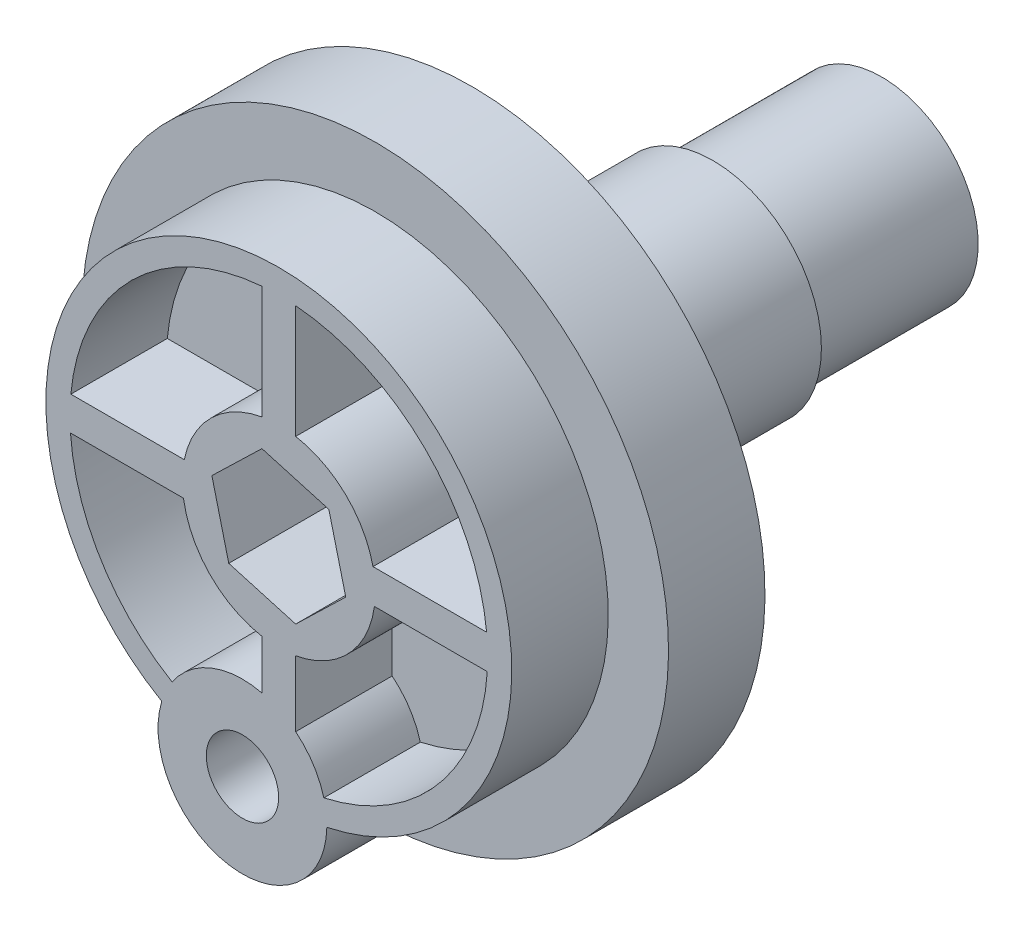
ISO-10303-21;
HEADER;
FILE_DESCRIPTION(('STEP AP214'),'2;1');
FILE_NAME('part.step','',(''),(''),'','','');
FILE_SCHEMA(('AUTOMOTIVE_DESIGN { 1 0 10303 214 1 1 1 1 }'));
ENDSEC;
DATA;
#1=APPLICATION_CONTEXT('core data for automotive mechanical design processes');
#2=APPLICATION_PROTOCOL_DEFINITION('international standard','automotive_design',2000,#1);
#3=PRODUCT_CONTEXT('',#1,'mechanical');
#4=PRODUCT('Part','Part','',(#3));
#5=PRODUCT_RELATED_PRODUCT_CATEGORY('part','',(#4));
#6=PRODUCT_DEFINITION_FORMATION('','',#4);
#7=PRODUCT_DEFINITION_CONTEXT('part definition',#1,'design');
#8=PRODUCT_DEFINITION('design','',#6,#7);
#9=PRODUCT_DEFINITION_SHAPE('','',#8);
#10=(LENGTH_UNIT() NAMED_UNIT(*) SI_UNIT(.MILLI.,.METRE.));
#11=(NAMED_UNIT(*) PLANE_ANGLE_UNIT() SI_UNIT($,.RADIAN.));
#12=(NAMED_UNIT(*) SI_UNIT($,.STERADIAN.) SOLID_ANGLE_UNIT());
#13=UNCERTAINTY_MEASURE_WITH_UNIT(LENGTH_MEASURE(1.E-05),#10,'distance_accuracy_value','');
#14=(GEOMETRIC_REPRESENTATION_CONTEXT(3) GLOBAL_UNCERTAINTY_ASSIGNED_CONTEXT((#13)) GLOBAL_UNIT_ASSIGNED_CONTEXT((#10,
#11,#12)) REPRESENTATION_CONTEXT('',''));
#15=CARTESIAN_POINT('',(0.,0.,0.));
#16=DIRECTION('',(0.,0.,1.));
#17=DIRECTION('',(1.,0.,0.));
#18=AXIS2_PLACEMENT_3D('',#15,#16,#17);
#19=CARTESIAN_POINT('',(0.,0.,-12.));
#20=DIRECTION('',(0.,0.,-1.));
#21=DIRECTION('',(-1.,0.,0.));
#22=AXIS2_PLACEMENT_3D('',#19,#20,#21);
#23=PLANE('',#22);
#24=CARTESIAN_POINT('',(0.,0.,-12.));
#25=DIRECTION('',(0.,0.,-1.));
#26=DIRECTION('',(-1.,0.,0.));
#27=AXIS2_PLACEMENT_3D('',#24,#25,#26);
#28=CIRCLE('',#27,4.5);
#29=CARTESIAN_POINT('',(-4.5,0.,-12.));
#30=VERTEX_POINT('',#29);
#31=EDGE_CURVE('E623',#30,#30,#28,.T.);
#32=ORIENTED_EDGE('',*,*,#31,.T.);
#33=EDGE_LOOP('',(#32));
#34=FACE_BOUND('',#33,.T.);
#35=CARTESIAN_POINT('',(0.,0.,-12.));
#36=DIRECTION('',(0.,0.,-1.));
#37=DIRECTION('',(-1.,0.,0.));
#38=AXIS2_PLACEMENT_3D('',#35,#36,#37);
#39=CIRCLE('',#38,4.);
#40=CARTESIAN_POINT('',(-4.,0.,-12.));
#41=VERTEX_POINT('',#40);
#42=EDGE_CURVE('E617',#41,#41,#39,.T.);
#43=ORIENTED_EDGE('',*,*,#42,.F.);
#44=EDGE_LOOP('',(#43));
#45=FACE_BOUND('',#44,.T.);
#46=ADVANCED_FACE('F348',(#34,#45),#23,.T.);
#47=CARTESIAN_POINT('',(0.,0.,0.));
#48=DIRECTION('',(0.,0.,1.));
#49=DIRECTION('',(1.,0.,0.));
#50=AXIS2_PLACEMENT_3D('',#47,#48,#49);
#51=PLANE('',#50);
#52=CARTESIAN_POINT('',(0.,0.,0.));
#53=DIRECTION('',(0.,0.,-1.));
#54=DIRECTION('',(-1.,0.,0.));
#55=AXIS2_PLACEMENT_3D('',#52,#53,#54);
#56=CIRCLE('',#55,11.16);
#57=CARTESIAN_POINT('',(-4.95189957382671,-10.0012144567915,0.));
#58=VERTEX_POINT('',#57);
#59=CARTESIAN_POINT('',(1.56886788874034,-11.0491743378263,0.));
#60=VERTEX_POINT('',#59);
#61=EDGE_CURVE('E550',#58,#60,#56,.T.);
#62=ORIENTED_EDGE('',*,*,#61,.T.);
#63=CARTESIAN_POINT('',(-1.50747036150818,-9.38,0.));
#64=DIRECTION('',(0.,0.,1.));
#65=DIRECTION('',(1.,0.,0.));
#66=AXIS2_PLACEMENT_3D('',#63,#64,#65);
#67=CIRCLE('',#66,3.5);
#68=EDGE_CURVE('E362',#60,#58,#67,.T.);
#69=ORIENTED_EDGE('',*,*,#68,.T.);
#70=EDGE_LOOP('',(#62,#69));
#71=FACE_BOUND('',#70,.T.);
#72=CARTESIAN_POINT('',(0.,0.,0.));
#73=DIRECTION('',(0.,0.,1.));
#74=DIRECTION('',(1.,0.,0.));
#75=AXIS2_PLACEMENT_3D('',#72,#73,#74);
#76=CIRCLE('',#75,4.5);
#77=CARTESIAN_POINT('',(4.5,0.,0.));
#78=VERTEX_POINT('',#77);
#79=EDGE_CURVE('E356',#78,#78,#76,.F.);
#80=ORIENTED_EDGE('',*,*,#79,.F.);
#81=EDGE_LOOP('',(#80));
#82=FACE_BOUND('',#81,.T.);
#83=ADVANCED_FACE('F777',(#71,#82),#51,.F.);
#84=CARTESIAN_POINT('',(0.,0.,2.));
#85=DIRECTION('',(0.,0.,1.));
#86=DIRECTION('',(1.,0.,0.));
#87=AXIS2_PLACEMENT_3D('',#84,#85,#86);
#88=PLANE('',#87);
#89=CARTESIAN_POINT('',(-1.50747036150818,-9.38,2.));
#90=DIRECTION('',(0.,0.,1.));
#91=DIRECTION('',(1.,0.,0.));
#92=AXIS2_PLACEMENT_3D('',#89,#90,#91);
#93=CIRCLE('',#92,3.5);
#94=CARTESIAN_POINT('',(-4.8532083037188,-8.35236308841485,2.));
#95=VERTEX_POINT('',#94);
#96=CARTESIAN_POINT('',(-4.41336996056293,-11.3308325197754,2.));
#97=VERTEX_POINT('',#96);
#98=EDGE_CURVE('E589',#95,#97,#93,.T.);
#99=ORIENTED_EDGE('',*,*,#98,.F.);
#100=CARTESIAN_POINT('',(0.,0.,2.));
#101=DIRECTION('',(0.,0.,1.));
#102=DIRECTION('',(1.,0.,0.));
#103=AXIS2_PLACEMENT_3D('',#100,#101,#102);
#104=CIRCLE('',#103,9.66);
#105=CARTESIAN_POINT('',(1.99178013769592,-9.45242888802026,2.));
#106=VERTEX_POINT('',#105);
#107=EDGE_CURVE('E761',#106,#95,#104,.T.);
#108=ORIENTED_EDGE('',*,*,#107,.F.);
#109=CARTESIAN_POINT('',(0.640847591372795,-12.1431015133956,2.));
#110=VERTEX_POINT('',#109);
#111=EDGE_CURVE('E586',#110,#106,#93,.T.);
#112=ORIENTED_EDGE('',*,*,#111,.F.);
#113=CARTESIAN_POINT('',(0.,0.,2.));
#114=DIRECTION('',(0.,0.,1.));
#115=DIRECTION('',(1.,0.,0.));
#116=AXIS2_PLACEMENT_3D('',#113,#114,#115);
#117=CIRCLE('',#116,12.16);
#118=EDGE_CURVE('E770',#110,#97,#117,.T.);
#119=ORIENTED_EDGE('',*,*,#118,.T.);
#120=EDGE_LOOP('',(#99,#108,#112,#119));
#121=FACE_BOUND('',#120,.T.);
#122=ADVANCED_FACE('F779',(#121),#88,.T.);
#123=CARTESIAN_POINT('',(0.,0.,2.));
#124=DIRECTION('',(0.,0.,-1.));
#125=DIRECTION('',(-1.,0.,0.));
#126=AXIS2_PLACEMENT_3D('',#123,#124,#125);
#127=CYLINDRICAL_SURFACE('',#126,12.16);
#128=CARTESIAN_POINT('',(0.,0.,-2.));
#129=DIRECTION('',(0.,0.,-1.));
#130=DIRECTION('',(-1.,0.,0.));
#131=AXIS2_PLACEMENT_3D('',#128,#129,#130);
#132=CIRCLE('',#131,12.16);
#133=CARTESIAN_POINT('',(-4.41336996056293,-11.3308325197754,-2.));
#134=VERTEX_POINT('',#133);
#135=CARTESIAN_POINT('',(0.640847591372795,-12.1431015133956,-2.));
#136=VERTEX_POINT('',#135);
#137=EDGE_CURVE('E549',#134,#136,#132,.T.);
#138=ORIENTED_EDGE('',*,*,#137,.F.);
#139=DIRECTION('',(0.,0.,1.));
#140=VECTOR('',#139,1.);
#141=CARTESIAN_POINT('',(-4.41336996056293,-11.3308325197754,2.));
#142=LINE('',#141,#140);
#143=EDGE_CURVE('E556',#134,#97,#142,.T.);
#144=ORIENTED_EDGE('',*,*,#143,.T.);
#145=ORIENTED_EDGE('',*,*,#118,.F.);
#146=DIRECTION('',(0.,0.,1.));
#147=VECTOR('',#146,1.);
#148=CARTESIAN_POINT('',(0.640847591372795,-12.1431015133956,2.));
#149=LINE('',#148,#147);
#150=EDGE_CURVE('E588',#110,#136,#149,.F.);
#151=ORIENTED_EDGE('',*,*,#150,.T.);
#152=EDGE_LOOP('',(#138,#144,#145,#151));
#153=FACE_BOUND('',#152,.T.);
#154=ADVANCED_FACE('F350',(#153),#127,.T.);
#155=CARTESIAN_POINT('',(0.,0.,-2.));
#156=DIRECTION('',(0.,0.,-1.));
#157=DIRECTION('',(-1.,0.,0.));
#158=AXIS2_PLACEMENT_3D('',#155,#156,#157);
#159=PLANE('',#158);
#160=CARTESIAN_POINT('',(-1.50747036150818,-9.38,-2.));
#161=DIRECTION('',(0.,0.,-1.));
#162=DIRECTION('',(-1.,0.,0.));
#163=AXIS2_PLACEMENT_3D('',#160,#161,#162);
#164=CIRCLE('',#163,1.5);
#165=CARTESIAN_POINT('',(-3.00747036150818,-9.38,-2.));
#166=VERTEX_POINT('',#165);
#167=EDGE_CURVE('E926',#166,#166,#164,.T.);
#168=ORIENTED_EDGE('',*,*,#167,.F.);
#169=EDGE_LOOP('',(#168));
#170=FACE_BOUND('',#169,.T.);
#171=ORIENTED_EDGE('',*,*,#137,.T.);
#172=CARTESIAN_POINT('',(-1.50747036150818,-9.38,-2.));
#173=DIRECTION('',(0.,0.,1.));
#174=DIRECTION('',(1.,0.,0.));
#175=AXIS2_PLACEMENT_3D('',#172,#173,#174);
#176=CIRCLE('',#175,3.5);
#177=EDGE_CURVE('E559',#134,#136,#176,.T.);
#178=ORIENTED_EDGE('',*,*,#177,.F.);
#179=EDGE_LOOP('',(#171,#178));
#180=FACE_BOUND('',#179,.T.);
#181=CARTESIAN_POINT('',(1.56886788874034,-11.0491743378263,-2.));
#182=VERTEX_POINT('',#181);
#183=CARTESIAN_POINT('',(-4.95189957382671,-10.0012144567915,-2.));
#184=VERTEX_POINT('',#183);
#185=EDGE_CURVE('E548',#182,#184,#176,.T.);
#186=ORIENTED_EDGE('',*,*,#185,.F.);
#187=CARTESIAN_POINT('',(0.,0.,-2.));
#188=DIRECTION('',(0.,0.,-1.));
#189=DIRECTION('',(-1.,0.,0.));
#190=AXIS2_PLACEMENT_3D('',#187,#188,#189);
#191=CIRCLE('',#190,11.16);
#192=EDGE_CURVE('E544',#184,#182,#191,.T.);
#193=ORIENTED_EDGE('',*,*,#192,.F.);
#194=EDGE_LOOP('',(#186,#193));
#195=FACE_BOUND('',#194,.T.);
#196=ADVANCED_FACE('F546',(#170,#180,#195),#159,.T.);
#197=CARTESIAN_POINT('',(0.,0.,-2.));
#198=DIRECTION('',(0.,0.,1.));
#199=DIRECTION('',(1.,0.,0.));
#200=AXIS2_PLACEMENT_3D('',#197,#198,#199);
#201=CYLINDRICAL_SURFACE('',#200,11.16);
#202=DIRECTION('',(0.,0.,1.));
#203=VECTOR('',#202,1.);
#204=CARTESIAN_POINT('',(1.56886788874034,-11.0491743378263,2.));
#205=LINE('',#204,#203);
#206=EDGE_CURVE('E369',#60,#182,#205,.F.);
#207=ORIENTED_EDGE('',*,*,#206,.F.);
#208=ORIENTED_EDGE('',*,*,#61,.F.);
#209=DIRECTION('',(0.,0.,1.));
#210=VECTOR('',#209,1.);
#211=CARTESIAN_POINT('',(-4.95189957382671,-10.0012144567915,2.));
#212=LINE('',#211,#210);
#213=EDGE_CURVE('E553',#184,#58,#212,.T.);
#214=ORIENTED_EDGE('',*,*,#213,.F.);
#215=ORIENTED_EDGE('',*,*,#192,.T.);
#216=EDGE_LOOP('',(#207,#208,#214,#215));
#217=FACE_BOUND('',#216,.T.);
#218=ADVANCED_FACE('F554',(#217),#201,.F.);
#219=CARTESIAN_POINT('',(0.,0.,6.));
#220=DIRECTION('',(0.,0.,1.));
#221=DIRECTION('',(1.,0.,0.));
#222=AXIS2_PLACEMENT_3D('',#219,#220,#221);
#223=PLANE('',#222);
#224=CARTESIAN_POINT('',(-1.50747036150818,-9.38,6.));
#225=DIRECTION('',(0.,0.,1.));
#226=DIRECTION('',(1.,0.,0.));
#227=AXIS2_PLACEMENT_3D('',#224,#225,#226);
#228=CIRCLE('',#227,1.5);
#229=CARTESIAN_POINT('',(-0.00747036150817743,-9.38,6.));
#230=VERTEX_POINT('',#229);
#231=EDGE_CURVE('E939',#230,#230,#228,.T.);
#232=ORIENTED_EDGE('',*,*,#231,.F.);
#233=EDGE_LOOP('',(#232));
#234=FACE_BOUND('',#233,.T.);
#235=DIRECTION('',(0.,1.,0.));
#236=VECTOR('',#235,1.);
#237=CARTESIAN_POINT('',(-0.699999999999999,-5.97450650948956,6.));
#238=LINE('',#237,#236);
#239=CARTESIAN_POINT('',(-0.699999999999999,-5.97441758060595,6.));
#240=VERTEX_POINT('',#239);
#241=CARTESIAN_POINT('',(-0.700000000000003,-3.93827373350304,6.));
#242=VERTEX_POINT('',#241);
#243=EDGE_CURVE('E716',#240,#242,#238,.T.);
#244=ORIENTED_EDGE('',*,*,#243,.F.);
#245=CARTESIAN_POINT('',(-1.50747036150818,-9.38,6.));
#246=DIRECTION('',(0.,0.,1.));
#247=DIRECTION('',(1.,0.,0.));
#248=AXIS2_PLACEMENT_3D('',#245,#246,#247);
#249=CIRCLE('',#248,3.5);
#250=CARTESIAN_POINT('',(-4.42382022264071,-7.44482468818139,6.));
#251=VERTEX_POINT('',#250);
#252=EDGE_CURVE('E564',#240,#251,#249,.T.);
#253=ORIENTED_EDGE('',*,*,#252,.T.);
#254=CARTESIAN_POINT('',(0.,0.,6.));
#255=DIRECTION('',(0.,0.,1.));
#256=DIRECTION('',(1.,0.,0.));
#257=AXIS2_PLACEMENT_3D('',#254,#255,#256);
#258=CIRCLE('',#257,8.66);
#259=CARTESIAN_POINT('',(-8.63877657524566,-0.605920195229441,6.));
#260=VERTEX_POINT('',#259);
#261=EDGE_CURVE('E714',#260,#251,#258,.T.);
#262=ORIENTED_EDGE('',*,*,#261,.F.);
#263=DIRECTION('',(-1.,0.,0.));
#264=VECTOR('',#263,1.);
#265=CARTESIAN_POINT('',(-3.95384126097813,-0.605920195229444,6.));
#266=LINE('',#265,#264);
#267=CARTESIAN_POINT('',(-3.95384126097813,-0.605920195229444,6.));
#268=VERTEX_POINT('',#267);
#269=EDGE_CURVE('E720',#268,#260,#266,.T.);
#270=ORIENTED_EDGE('',*,*,#269,.F.);
#271=CARTESIAN_POINT('',(0.,0.,6.));
#272=DIRECTION('',(0.,0.,-1.));
#273=DIRECTION('',(1.,0.,0.));
#274=AXIS2_PLACEMENT_3D('',#271,#272,#273);
#275=CIRCLE('',#274,4.);
#276=EDGE_CURVE('E718',#242,#268,#275,.T.);
#277=ORIENTED_EDGE('',*,*,#276,.F.);
#278=EDGE_LOOP('',(#244,#253,#262,#270,#277));
#279=FACE_BOUND('',#278,.T.);
#280=CARTESIAN_POINT('',(0.,0.,6.));
#281=DIRECTION('',(0.,0.,1.));
#282=DIRECTION('',(1.,0.,0.));
#283=AXIS2_PLACEMENT_3D('',#280,#281,#282);
#284=CIRCLE('',#283,9.65999999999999);
#285=CARTESIAN_POINT('',(1.99178013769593,-9.45242888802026,6.));
#286=VERTEX_POINT('',#285);
#287=CARTESIAN_POINT('',(-4.8532083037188,-8.35236308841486,6.));
#288=VERTEX_POINT('',#287);
#289=EDGE_CURVE('E764',#286,#288,#284,.T.);
#290=ORIENTED_EDGE('',*,*,#289,.T.);
#291=EDGE_CURVE('E566',#288,#286,#249,.T.);
#292=ORIENTED_EDGE('',*,*,#291,.T.);
#293=EDGE_LOOP('',(#290,#292));
#294=FACE_BOUND('',#293,.T.);
#295=CARTESIAN_POINT('',(1.8683727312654,-8.45605010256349,6.));
#296=VERTEX_POINT('',#295);
#297=CARTESIAN_POINT('',(0.699999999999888,-6.6639229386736,6.));
#298=VERTEX_POINT('',#297);
#299=EDGE_CURVE('E560',#296,#298,#249,.T.);
#300=ORIENTED_EDGE('',*,*,#299,.T.);
#301=DIRECTION('',(0.,-1.,0.));
#302=VECTOR('',#301,1.);
#303=CARTESIAN_POINT('',(0.699999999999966,-3.93827373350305,6.));
#304=LINE('',#303,#302);
#305=CARTESIAN_POINT('',(0.699999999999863,-3.93827373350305,6.));
#306=VERTEX_POINT('',#305);
#307=EDGE_CURVE('E695',#306,#298,#304,.T.);
#308=ORIENTED_EDGE('',*,*,#307,.F.);
#309=CARTESIAN_POINT('',(0.,0.,6.));
#310=DIRECTION('',(0.,0.,-1.));
#311=DIRECTION('',(1.,0.,0.));
#312=AXIS2_PLACEMENT_3D('',#309,#310,#311);
#313=CIRCLE('',#312,4.);
#314=CARTESIAN_POINT('',(3.96415770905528,-0.534278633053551,6.));
#315=VERTEX_POINT('',#314);
#316=EDGE_CURVE('E692',#315,#306,#313,.T.);
#317=ORIENTED_EDGE('',*,*,#316,.F.);
#318=DIRECTION('',(-1.,0.,0.));
#319=VECTOR('',#318,1.);
#320=CARTESIAN_POINT('',(3.96415770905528,-0.534278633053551,6.));
#321=LINE('',#320,#319);
#322=CARTESIAN_POINT('',(8.64350312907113,-0.53427863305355,6.));
#323=VERTEX_POINT('',#322);
#324=EDGE_CURVE('E690',#323,#315,#321,.T.);
#325=ORIENTED_EDGE('',*,*,#324,.F.);
#326=CARTESIAN_POINT('',(0.,0.,6.));
#327=DIRECTION('',(0.,0.,1.));
#328=DIRECTION('',(1.,0.,0.));
#329=AXIS2_PLACEMENT_3D('',#326,#327,#328);
#330=CIRCLE('',#329,8.66);
#331=EDGE_CURVE('E688',#296,#323,#330,.T.);
#332=ORIENTED_EDGE('',*,*,#331,.F.);
#333=EDGE_LOOP('',(#300,#308,#317,#325,#332));
#334=FACE_BOUND('',#333,.T.);
#335=DIRECTION('',(0.718934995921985,0.695077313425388,0.));
#336=VECTOR('',#335,1.);
#337=CARTESIAN_POINT('',(0.699999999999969,-2.80059517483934,6.));
#338=LINE('',#337,#336);
#339=CARTESIAN_POINT('',(0.699999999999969,-2.80059517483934,6.));
#340=VERTEX_POINT('',#339);
#341=CARTESIAN_POINT('',(2.77538656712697,-0.794079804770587,6.));
#342=VERTEX_POINT('',#341);
#343=EDGE_CURVE('E657',#340,#342,#338,.T.);
#344=ORIENTED_EDGE('',*,*,#343,.F.);
#345=DIRECTION('',(0.961422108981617,-0.275077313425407,0.));
#346=VECTOR('',#345,1.);
#347=CARTESIAN_POINT('',(-2.075386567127,-2.00651537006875,6.));
#348=LINE('',#347,#346);
#349=CARTESIAN_POINT('',(-2.075386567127,-2.00651537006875,6.));
#350=VERTEX_POINT('',#349);
#351=EDGE_CURVE('E655',#350,#340,#348,.T.);
#352=ORIENTED_EDGE('',*,*,#351,.F.);
#353=DIRECTION('',(0.242487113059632,-0.970154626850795,0.));
#354=VECTOR('',#353,1.);
#355=CARTESIAN_POINT('',(-2.77538656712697,0.794079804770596,6.));
#356=LINE('',#355,#354);
#357=CARTESIAN_POINT('',(-2.77538656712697,0.794079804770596,6.));
#358=VERTEX_POINT('',#357);
#359=EDGE_CURVE('E666',#358,#350,#356,.T.);
#360=ORIENTED_EDGE('',*,*,#359,.F.);
#361=DIRECTION('',(-0.718934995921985,-0.695077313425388,0.));
#362=VECTOR('',#361,1.);
#363=CARTESIAN_POINT('',(-0.699999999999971,2.80059517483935,6.));
#364=LINE('',#363,#362);
#365=CARTESIAN_POINT('',(-0.699999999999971,2.80059517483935,6.));
#366=VERTEX_POINT('',#365);
#367=EDGE_CURVE('E663',#366,#358,#364,.T.);
#368=ORIENTED_EDGE('',*,*,#367,.F.);
#369=DIRECTION('',(-0.961422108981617,0.275077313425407,0.));
#370=VECTOR('',#369,1.);
#371=CARTESIAN_POINT('',(2.075386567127,2.00651537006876,6.));
#372=LINE('',#371,#370);
#373=CARTESIAN_POINT('',(2.075386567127,2.00651537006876,6.));
#374=VERTEX_POINT('',#373);
#375=EDGE_CURVE('E661',#374,#366,#372,.T.);
#376=ORIENTED_EDGE('',*,*,#375,.F.);
#377=DIRECTION('',(-0.242487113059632,0.970154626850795,0.));
#378=VECTOR('',#377,1.);
#379=CARTESIAN_POINT('',(2.77538656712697,-0.794079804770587,6.));
#380=LINE('',#379,#378);
#381=EDGE_CURVE('E659',#342,#374,#380,.T.);
#382=ORIENTED_EDGE('',*,*,#381,.F.);
#383=EDGE_LOOP('',(#344,#352,#360,#368,#376,#382));
#384=FACE_BOUND('',#383,.T.);
#385=DIRECTION('',(1.,0.,0.));
#386=VECTOR('',#385,1.);
#387=CARTESIAN_POINT('',(-3.92038738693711,0.794079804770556,6.));
#388=LINE('',#387,#386);
#389=CARTESIAN_POINT('',(-8.62351652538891,0.794079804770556,6.));
#390=VERTEX_POINT('',#389);
#391=CARTESIAN_POINT('',(-3.92038738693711,0.794079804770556,6.));
#392=VERTEX_POINT('',#391);
#393=EDGE_CURVE('E742',#390,#392,#388,.T.);
#394=ORIENTED_EDGE('',*,*,#393,.F.);
#395=CARTESIAN_POINT('',(0.,0.,6.));
#396=DIRECTION('',(0.,0.,1.));
#397=DIRECTION('',(-1.,0.,0.));
#398=AXIS2_PLACEMENT_3D('',#395,#396,#397);
#399=CIRCLE('',#398,8.66);
#400=CARTESIAN_POINT('',(-0.700000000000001,8.63166264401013,6.));
#401=VERTEX_POINT('',#400);
#402=EDGE_CURVE('E740',#401,#390,#399,.T.);
#403=ORIENTED_EDGE('',*,*,#402,.F.);
#404=DIRECTION('',(0.,1.,0.));
#405=VECTOR('',#404,1.);
#406=CARTESIAN_POINT('',(-0.700000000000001,8.63166264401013,6.));
#407=LINE('',#406,#405);
#408=CARTESIAN_POINT('',(-0.7,3.93827373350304,6.));
#409=VERTEX_POINT('',#408);
#410=EDGE_CURVE('E747',#409,#401,#407,.T.);
#411=ORIENTED_EDGE('',*,*,#410,.F.);
#412=CARTESIAN_POINT('',(0.,0.,6.));
#413=DIRECTION('',(0.,0.,-1.));
#414=DIRECTION('',(-1.,0.,0.));
#415=AXIS2_PLACEMENT_3D('',#412,#413,#414);
#416=CIRCLE('',#415,4.);
#417=EDGE_CURVE('E744',#392,#409,#416,.T.);
#418=ORIENTED_EDGE('',*,*,#417,.F.);
#419=EDGE_LOOP('',(#394,#403,#411,#418));
#420=FACE_BOUND('',#419,.T.);
#421=DIRECTION('',(0.,-1.,0.));
#422=VECTOR('',#421,1.);
#423=CARTESIAN_POINT('',(0.699999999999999,8.63166264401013,6.));
#424=LINE('',#423,#422);
#425=CARTESIAN_POINT('',(0.699999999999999,8.63166264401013,6.));
#426=VERTEX_POINT('',#425);
#427=CARTESIAN_POINT('',(0.7,3.93827373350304,6.));
#428=VERTEX_POINT('',#427);
#429=EDGE_CURVE('E636',#426,#428,#424,.T.);
#430=ORIENTED_EDGE('',*,*,#429,.F.);
#431=CARTESIAN_POINT('',(0.,0.,6.));
#432=DIRECTION('',(0.,0.,1.));
#433=DIRECTION('',(1.,0.,0.));
#434=AXIS2_PLACEMENT_3D('',#431,#432,#433);
#435=CIRCLE('',#434,8.66);
#436=CARTESIAN_POINT('',(8.61661920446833,0.865721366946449,6.));
#437=VERTEX_POINT('',#436);
#438=EDGE_CURVE('E634',#437,#426,#435,.T.);
#439=ORIENTED_EDGE('',*,*,#438,.F.);
#440=DIRECTION('',(1.,0.,0.));
#441=VECTOR('',#440,1.);
#442=CARTESIAN_POINT('',(8.61661920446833,0.865721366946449,6.));
#443=LINE('',#442,#441);
#444=CARTESIAN_POINT('',(3.90519225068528,0.865721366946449,6.));
#445=VERTEX_POINT('',#444);
#446=EDGE_CURVE('E641',#445,#437,#443,.T.);
#447=ORIENTED_EDGE('',*,*,#446,.F.);
#448=CARTESIAN_POINT('',(0.,0.,6.));
#449=DIRECTION('',(0.,0.,-1.));
#450=DIRECTION('',(1.,0.,0.));
#451=AXIS2_PLACEMENT_3D('',#448,#449,#450);
#452=CIRCLE('',#451,4.);
#453=EDGE_CURVE('E638',#428,#445,#452,.T.);
#454=ORIENTED_EDGE('',*,*,#453,.F.);
#455=EDGE_LOOP('',(#430,#439,#447,#454));
#456=FACE_BOUND('',#455,.T.);
#457=ADVANCED_FACE('F822',(#234,#279,#294,#334,#384,#420,#456),#223,.T.);
#458=CARTESIAN_POINT('',(0.,0.,6.));
#459=DIRECTION('',(0.,0.,-1.));
#460=DIRECTION('',(-1.,0.,0.));
#461=AXIS2_PLACEMENT_3D('',#458,#459,#460);
#462=CYLINDRICAL_SURFACE('',#461,9.66);
#463=ORIENTED_EDGE('',*,*,#107,.T.);
#464=DIRECTION('',(0.,0.,1.));
#465=VECTOR('',#464,1.);
#466=CARTESIAN_POINT('',(-4.8532083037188,-8.35236308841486,2.));
#467=LINE('',#466,#465);
#468=EDGE_CURVE('E592',#95,#288,#467,.T.);
#469=ORIENTED_EDGE('',*,*,#468,.T.);
#470=ORIENTED_EDGE('',*,*,#289,.F.);
#471=DIRECTION('',(0.,0.,1.));
#472=VECTOR('',#471,1.);
#473=CARTESIAN_POINT('',(1.99178013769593,-9.45242888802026,2.));
#474=LINE('',#473,#472);
#475=EDGE_CURVE('E583',#286,#106,#474,.F.);
#476=ORIENTED_EDGE('',*,*,#475,.T.);
#477=EDGE_LOOP('',(#463,#469,#470,#476));
#478=FACE_BOUND('',#477,.T.);
#479=ADVANCED_FACE('F906',(#478),#462,.T.);
#480=CARTESIAN_POINT('',(0.,0.,6.));
#481=DIRECTION('',(0.,0.,-1.));
#482=DIRECTION('',(-1.,0.,0.));
#483=AXIS2_PLACEMENT_3D('',#480,#481,#482);
#484=CYLINDRICAL_SURFACE('',#483,8.66);
#485=CARTESIAN_POINT('',(0.,0.,2.));
#486=DIRECTION('',(0.,0.,1.));
#487=DIRECTION('',(-1.,0.,0.));
#488=AXIS2_PLACEMENT_3D('',#485,#486,#487);
#489=CIRCLE('',#488,8.66);
#490=CARTESIAN_POINT('',(-0.700000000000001,8.63166264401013,2.));
#491=VERTEX_POINT('',#490);
#492=CARTESIAN_POINT('',(-8.62351652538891,0.794079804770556,2.));
#493=VERTEX_POINT('',#492);
#494=EDGE_CURVE('E732',#491,#493,#489,.T.);
#495=ORIENTED_EDGE('',*,*,#494,.F.);
#496=DIRECTION('',(0.,0.,-1.));
#497=VECTOR('',#496,1.);
#498=CARTESIAN_POINT('',(-0.700000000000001,8.63166264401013,6.));
#499=LINE('',#498,#497);
#500=EDGE_CURVE('E749',#401,#491,#499,.T.);
#501=ORIENTED_EDGE('',*,*,#500,.F.);
#502=ORIENTED_EDGE('',*,*,#402,.T.);
#503=DIRECTION('',(0.,0.,-1.));
#504=VECTOR('',#503,1.);
#505=CARTESIAN_POINT('',(-8.62351652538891,0.794079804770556,6.));
#506=LINE('',#505,#504);
#507=EDGE_CURVE('E758',#390,#493,#506,.T.);
#508=ORIENTED_EDGE('',*,*,#507,.T.);
#509=EDGE_LOOP('',(#495,#501,#502,#508));
#510=FACE_BOUND('',#509,.T.);
#511=ADVANCED_FACE('F902',(#510),#484,.F.);
#512=CARTESIAN_POINT('',(-3.92038738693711,0.794079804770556,6.));
#513=DIRECTION('',(0.,1.,0.));
#514=DIRECTION('',(-1.,0.,0.));
#515=AXIS2_PLACEMENT_3D('',#512,#513,#514);
#516=PLANE('',#515);
#517=DIRECTION('',(1.,0.,0.));
#518=VECTOR('',#517,1.);
#519=CARTESIAN_POINT('',(-3.92038738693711,0.794079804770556,2.));
#520=LINE('',#519,#518);
#521=CARTESIAN_POINT('',(-3.92038738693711,0.794079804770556,2.));
#522=VERTEX_POINT('',#521);
#523=EDGE_CURVE('E734',#493,#522,#520,.T.);
#524=ORIENTED_EDGE('',*,*,#523,.F.);
#525=ORIENTED_EDGE('',*,*,#507,.F.);
#526=ORIENTED_EDGE('',*,*,#393,.T.);
#527=DIRECTION('',(0.,0.,-1.));
#528=VECTOR('',#527,1.);
#529=CARTESIAN_POINT('',(-3.92038738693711,0.794079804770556,6.));
#530=LINE('',#529,#528);
#531=EDGE_CURVE('E755',#392,#522,#530,.T.);
#532=ORIENTED_EDGE('',*,*,#531,.T.);
#533=EDGE_LOOP('',(#524,#525,#526,#532));
#534=FACE_BOUND('',#533,.T.);
#535=ADVANCED_FACE('F898',(#534),#516,.T.);
#536=CARTESIAN_POINT('',(0.,0.,6.));
#537=DIRECTION('',(0.,0.,-1.));
#538=DIRECTION('',(-1.,0.,0.));
#539=AXIS2_PLACEMENT_3D('',#536,#537,#538);
#540=CYLINDRICAL_SURFACE('',#539,4.);
#541=CARTESIAN_POINT('',(0.,0.,2.));
#542=DIRECTION('',(0.,0.,-1.));
#543=DIRECTION('',(-1.,0.,0.));
#544=AXIS2_PLACEMENT_3D('',#541,#542,#543);
#545=CIRCLE('',#544,4.);
#546=CARTESIAN_POINT('',(-0.7,3.93827373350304,2.));
#547=VERTEX_POINT('',#546);
#548=EDGE_CURVE('E736',#522,#547,#545,.T.);
#549=ORIENTED_EDGE('',*,*,#548,.F.);
#550=ORIENTED_EDGE('',*,*,#531,.F.);
#551=ORIENTED_EDGE('',*,*,#417,.T.);
#552=DIRECTION('',(0.,0.,-1.));
#553=VECTOR('',#552,1.);
#554=CARTESIAN_POINT('',(-0.7,3.93827373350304,6.));
#555=LINE('',#554,#553);
#556=EDGE_CURVE('E752',#409,#547,#555,.T.);
#557=ORIENTED_EDGE('',*,*,#556,.T.);
#558=EDGE_LOOP('',(#549,#550,#551,#557));
#559=FACE_BOUND('',#558,.T.);
#560=ADVANCED_FACE('F894',(#559),#540,.T.);
#561=CARTESIAN_POINT('',(-0.700000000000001,8.63166264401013,6.));
#562=DIRECTION('',(-1.,0.,0.));
#563=DIRECTION('',(0.,-1.,0.));
#564=AXIS2_PLACEMENT_3D('',#561,#562,#563);
#565=PLANE('',#564);
#566=DIRECTION('',(0.,1.,0.));
#567=VECTOR('',#566,1.);
#568=CARTESIAN_POINT('',(-0.700000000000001,8.63166264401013,2.));
#569=LINE('',#568,#567);
#570=EDGE_CURVE('E738',#547,#491,#569,.T.);
#571=ORIENTED_EDGE('',*,*,#570,.F.);
#572=ORIENTED_EDGE('',*,*,#556,.F.);
#573=ORIENTED_EDGE('',*,*,#410,.T.);
#574=ORIENTED_EDGE('',*,*,#500,.T.);
#575=EDGE_LOOP('',(#571,#572,#573,#574));
#576=FACE_BOUND('',#575,.T.);
#577=ADVANCED_FACE('F890',(#576),#565,.T.);
#578=CARTESIAN_POINT('',(-0.7,-3.93827373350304,6.));
#579=DIRECTION('',(-1.,0.,0.));
#580=DIRECTION('',(0.,-1.,0.));
#581=AXIS2_PLACEMENT_3D('',#578,#579,#580);
#582=PLANE('',#581);
#583=DIRECTION('',(0.,0.,1.));
#584=VECTOR('',#583,1.);
#585=CARTESIAN_POINT('',(-0.699999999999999,-5.97441758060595,-2.));
#586=LINE('',#585,#584);
#587=CARTESIAN_POINT('',(-0.699999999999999,-5.97441758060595,2.));
#588=VERTEX_POINT('',#587);
#589=EDGE_CURVE('E571',#240,#588,#586,.F.);
#590=ORIENTED_EDGE('',*,*,#589,.F.);
#591=ORIENTED_EDGE('',*,*,#243,.T.);
#592=DIRECTION('',(0.,0.,-1.));
#593=VECTOR('',#592,1.);
#594=CARTESIAN_POINT('',(-0.700000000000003,-3.93827373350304,6.));
#595=LINE('',#594,#593);
#596=CARTESIAN_POINT('',(-0.700000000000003,-3.93827373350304,2.));
#597=VERTEX_POINT('',#596);
#598=EDGE_CURVE('E729',#242,#597,#595,.T.);
#599=ORIENTED_EDGE('',*,*,#598,.T.);
#600=DIRECTION('',(0.,1.,0.));
#601=VECTOR('',#600,1.);
#602=CARTESIAN_POINT('',(-0.7,-3.93827373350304,2.));
#603=LINE('',#602,#601);
#604=EDGE_CURVE('E706',#588,#597,#603,.T.);
#605=ORIENTED_EDGE('',*,*,#604,.F.);
#606=EDGE_LOOP('',(#590,#591,#599,#605));
#607=FACE_BOUND('',#606,.T.);
#608=ADVANCED_FACE('F886',(#607),#582,.T.);
#609=CARTESIAN_POINT('',(0.,0.,6.));
#610=DIRECTION('',(0.,0.,-1.));
#611=DIRECTION('',(-1.,0.,0.));
#612=AXIS2_PLACEMENT_3D('',#609,#610,#611);
#613=CYLINDRICAL_SURFACE('',#612,4.);
#614=CARTESIAN_POINT('',(0.,0.,2.));
#615=DIRECTION('',(0.,0.,-1.));
#616=DIRECTION('',(1.,0.,0.));
#617=AXIS2_PLACEMENT_3D('',#614,#615,#616);
#618=CIRCLE('',#617,4.);
#619=CARTESIAN_POINT('',(-3.95384126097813,-0.605920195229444,2.));
#620=VERTEX_POINT('',#619);
#621=EDGE_CURVE('E708',#597,#620,#618,.T.);
#622=ORIENTED_EDGE('',*,*,#621,.F.);
#623=ORIENTED_EDGE('',*,*,#598,.F.);
#624=ORIENTED_EDGE('',*,*,#276,.T.);
#625=DIRECTION('',(0.,0.,-1.));
#626=VECTOR('',#625,1.);
#627=CARTESIAN_POINT('',(-3.95384126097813,-0.605920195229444,6.));
#628=LINE('',#627,#626);
#629=EDGE_CURVE('E726',#268,#620,#628,.T.);
#630=ORIENTED_EDGE('',*,*,#629,.T.);
#631=EDGE_LOOP('',(#622,#623,#624,#630));
#632=FACE_BOUND('',#631,.T.);
#633=ADVANCED_FACE('F882',(#632),#613,.T.);
#634=CARTESIAN_POINT('',(-3.95384126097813,-0.605920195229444,6.));
#635=DIRECTION('',(0.,-1.,0.));
#636=DIRECTION('',(1.,0.,0.));
#637=AXIS2_PLACEMENT_3D('',#634,#635,#636);
#638=PLANE('',#637);
#639=DIRECTION('',(-1.,0.,0.));
#640=VECTOR('',#639,1.);
#641=CARTESIAN_POINT('',(-3.95384126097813,-0.605920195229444,2.));
#642=LINE('',#641,#640);
#643=CARTESIAN_POINT('',(-8.63877657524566,-0.605920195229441,2.));
#644=VERTEX_POINT('',#643);
#645=EDGE_CURVE('E710',#620,#644,#642,.T.);
#646=ORIENTED_EDGE('',*,*,#645,.F.);
#647=ORIENTED_EDGE('',*,*,#629,.F.);
#648=ORIENTED_EDGE('',*,*,#269,.T.);
#649=DIRECTION('',(0.,0.,-1.));
#650=VECTOR('',#649,1.);
#651=CARTESIAN_POINT('',(-8.63877657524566,-0.605920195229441,6.));
#652=LINE('',#651,#650);
#653=EDGE_CURVE('E723',#260,#644,#652,.T.);
#654=ORIENTED_EDGE('',*,*,#653,.T.);
#655=EDGE_LOOP('',(#646,#647,#648,#654));
#656=FACE_BOUND('',#655,.T.);
#657=ADVANCED_FACE('F878',(#656),#638,.T.);
#658=CARTESIAN_POINT('',(0.,0.,6.));
#659=DIRECTION('',(0.,0.,-1.));
#660=DIRECTION('',(-1.,0.,0.));
#661=AXIS2_PLACEMENT_3D('',#658,#659,#660);
#662=CYLINDRICAL_SURFACE('',#661,8.66);
#663=DIRECTION('',(0.,0.,1.));
#664=VECTOR('',#663,1.);
#665=CARTESIAN_POINT('',(-4.42382022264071,-7.44482468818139,2.));
#666=LINE('',#665,#664);
#667=CARTESIAN_POINT('',(-4.42382022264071,-7.44482468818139,2.));
#668=VERTEX_POINT('',#667);
#669=EDGE_CURVE('E562',#668,#251,#666,.T.);
#670=ORIENTED_EDGE('',*,*,#669,.F.);
#671=CARTESIAN_POINT('',(0.,0.,2.));
#672=DIRECTION('',(0.,0.,1.));
#673=DIRECTION('',(1.,0.,0.));
#674=AXIS2_PLACEMENT_3D('',#671,#672,#673);
#675=CIRCLE('',#674,8.66);
#676=EDGE_CURVE('E712',#644,#668,#675,.T.);
#677=ORIENTED_EDGE('',*,*,#676,.F.);
#678=ORIENTED_EDGE('',*,*,#653,.F.);
#679=ORIENTED_EDGE('',*,*,#261,.T.);
#680=EDGE_LOOP('',(#670,#677,#678,#679));
#681=FACE_BOUND('',#680,.T.);
#682=ADVANCED_FACE('F874',(#681),#662,.F.);
#683=CARTESIAN_POINT('',(0.,0.,6.));
#684=DIRECTION('',(0.,0.,-1.));
#685=DIRECTION('',(-1.,0.,0.));
#686=AXIS2_PLACEMENT_3D('',#683,#684,#685);
#687=CYLINDRICAL_SURFACE('',#686,8.66);
#688=DIRECTION('',(0.,0.,1.));
#689=VECTOR('',#688,1.);
#690=CARTESIAN_POINT('',(1.8683727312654,-8.45605010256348,2.));
#691=LINE('',#690,#689);
#692=CARTESIAN_POINT('',(1.8683727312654,-8.45605010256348,2.));
#693=VERTEX_POINT('',#692);
#694=EDGE_CURVE('E580',#296,#693,#691,.F.);
#695=ORIENTED_EDGE('',*,*,#694,.F.);
#696=ORIENTED_EDGE('',*,*,#331,.T.);
#697=DIRECTION('',(0.,0.,-1.));
#698=VECTOR('',#697,1.);
#699=CARTESIAN_POINT('',(8.64350312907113,-0.53427863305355,6.));
#700=LINE('',#699,#698);
#701=CARTESIAN_POINT('',(8.64350312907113,-0.534278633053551,2.));
#702=VERTEX_POINT('',#701);
#703=EDGE_CURVE('E703',#323,#702,#700,.T.);
#704=ORIENTED_EDGE('',*,*,#703,.T.);
#705=CARTESIAN_POINT('',(0.,0.,2.));
#706=DIRECTION('',(0.,0.,1.));
#707=DIRECTION('',(1.,0.,0.));
#708=AXIS2_PLACEMENT_3D('',#705,#706,#707);
#709=CIRCLE('',#708,8.66);
#710=EDGE_CURVE('E680',#693,#702,#709,.T.);
#711=ORIENTED_EDGE('',*,*,#710,.F.);
#712=EDGE_LOOP('',(#695,#696,#704,#711));
#713=FACE_BOUND('',#712,.T.);
#714=ADVANCED_FACE('F870',(#713),#687,.F.);
#715=CARTESIAN_POINT('',(3.96415770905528,-0.534278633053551,6.));
#716=DIRECTION('',(0.,-1.,0.));
#717=DIRECTION('',(1.,0.,0.));
#718=AXIS2_PLACEMENT_3D('',#715,#716,#717);
#719=PLANE('',#718);
#720=DIRECTION('',(-1.,0.,0.));
#721=VECTOR('',#720,1.);
#722=CARTESIAN_POINT('',(3.96415770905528,-0.534278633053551,2.));
#723=LINE('',#722,#721);
#724=CARTESIAN_POINT('',(3.96415770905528,-0.534278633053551,2.));
#725=VERTEX_POINT('',#724);
#726=EDGE_CURVE('E682',#702,#725,#723,.T.);
#727=ORIENTED_EDGE('',*,*,#726,.F.);
#728=ORIENTED_EDGE('',*,*,#703,.F.);
#729=ORIENTED_EDGE('',*,*,#324,.T.);
#730=DIRECTION('',(0.,0.,-1.));
#731=VECTOR('',#730,1.);
#732=CARTESIAN_POINT('',(3.96415770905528,-0.534278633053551,6.));
#733=LINE('',#732,#731);
#734=EDGE_CURVE('E700',#315,#725,#733,.T.);
#735=ORIENTED_EDGE('',*,*,#734,.T.);
#736=EDGE_LOOP('',(#727,#728,#729,#735));
#737=FACE_BOUND('',#736,.T.);
#738=ADVANCED_FACE('F866',(#737),#719,.T.);
#739=CARTESIAN_POINT('',(0.,0.,6.));
#740=DIRECTION('',(0.,0.,-1.));
#741=DIRECTION('',(-1.,0.,0.));
#742=AXIS2_PLACEMENT_3D('',#739,#740,#741);
#743=CYLINDRICAL_SURFACE('',#742,4.);
#744=CARTESIAN_POINT('',(0.,0.,2.));
#745=DIRECTION('',(0.,0.,-1.));
#746=DIRECTION('',(1.,0.,0.));
#747=AXIS2_PLACEMENT_3D('',#744,#745,#746);
#748=CIRCLE('',#747,4.);
#749=CARTESIAN_POINT('',(0.699999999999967,-3.93827373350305,2.));
#750=VERTEX_POINT('',#749);
#751=EDGE_CURVE('E684',#725,#750,#748,.T.);
#752=ORIENTED_EDGE('',*,*,#751,.F.);
#753=ORIENTED_EDGE('',*,*,#734,.F.);
#754=ORIENTED_EDGE('',*,*,#316,.T.);
#755=DIRECTION('',(0.,0.,-1.));
#756=VECTOR('',#755,1.);
#757=CARTESIAN_POINT('',(0.699999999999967,-3.93827373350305,6.));
#758=LINE('',#757,#756);
#759=EDGE_CURVE('E697',#306,#750,#758,.T.);
#760=ORIENTED_EDGE('',*,*,#759,.T.);
#761=EDGE_LOOP('',(#752,#753,#754,#760));
#762=FACE_BOUND('',#761,.T.);
#763=ADVANCED_FACE('F862',(#762),#743,.T.);
#764=CARTESIAN_POINT('',(0.699999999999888,-6.66741942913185,6.));
#765=DIRECTION('',(1.,0.,0.));
#766=DIRECTION('',(0.,1.,0.));
#767=AXIS2_PLACEMENT_3D('',#764,#765,#766);
#768=PLANE('',#767);
#769=DIRECTION('',(0.,0.,1.));
#770=VECTOR('',#769,1.);
#771=CARTESIAN_POINT('',(0.699999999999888,-6.6639229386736,-2.));
#772=LINE('',#771,#770);
#773=CARTESIAN_POINT('',(0.699999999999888,-6.6639229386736,2.));
#774=VERTEX_POINT('',#773);
#775=EDGE_CURVE('E577',#774,#298,#772,.T.);
#776=ORIENTED_EDGE('',*,*,#775,.F.);
#777=DIRECTION('',(0.,-1.,0.));
#778=VECTOR('',#777,1.);
#779=CARTESIAN_POINT('',(0.699999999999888,-6.66741942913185,2.));
#780=LINE('',#779,#778);
#781=EDGE_CURVE('E686',#750,#774,#780,.T.);
#782=ORIENTED_EDGE('',*,*,#781,.F.);
#783=ORIENTED_EDGE('',*,*,#759,.F.);
#784=ORIENTED_EDGE('',*,*,#307,.T.);
#785=EDGE_LOOP('',(#776,#782,#783,#784));
#786=FACE_BOUND('',#785,.T.);
#787=ADVANCED_FACE('F858',(#786),#768,.T.);
#788=CARTESIAN_POINT('',(-2.075386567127,-2.00651537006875,6.));
#789=DIRECTION('',(0.275077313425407,0.961422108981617,0.));
#790=DIRECTION('',(-0.961422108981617,0.275077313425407,0.));
#791=AXIS2_PLACEMENT_3D('',#788,#789,#790);
#792=PLANE('',#791);
#793=DIRECTION('',(0.,0.,-1.));
#794=VECTOR('',#793,1.);
#795=CARTESIAN_POINT('',(0.699999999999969,-2.80059517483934,6.));
#796=LINE('',#795,#794);
#797=CARTESIAN_POINT('',(0.699999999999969,-2.80059517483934,-19.));
#798=VERTEX_POINT('',#797);
#799=EDGE_CURVE('E678',#340,#798,#796,.T.);
#800=ORIENTED_EDGE('',*,*,#799,.T.);
#801=DIRECTION('',(0.961422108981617,-0.275077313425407,0.));
#802=VECTOR('',#801,1.);
#803=CARTESIAN_POINT('',(-2.075386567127,-2.00651537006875,-19.));
#804=LINE('',#803,#802);
#805=CARTESIAN_POINT('',(-2.075386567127,-2.00651537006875,-19.));
#806=VERTEX_POINT('',#805);
#807=EDGE_CURVE('E605',#806,#798,#804,.T.);
#808=ORIENTED_EDGE('',*,*,#807,.F.);
#809=DIRECTION('',(0.,0.,-1.));
#810=VECTOR('',#809,1.);
#811=CARTESIAN_POINT('',(-2.075386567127,-2.00651537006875,6.));
#812=LINE('',#811,#810);
#813=EDGE_CURVE('E668',#350,#806,#812,.T.);
#814=ORIENTED_EDGE('',*,*,#813,.F.);
#815=ORIENTED_EDGE('',*,*,#351,.T.);
#816=EDGE_LOOP('',(#800,#808,#814,#815));
#817=FACE_BOUND('',#816,.T.);
#818=ADVANCED_FACE('F854',(#817),#792,.T.);
#819=CARTESIAN_POINT('',(0.699999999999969,-2.80059517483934,6.));
#820=DIRECTION('',(-0.695077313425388,0.718934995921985,0.));
#821=DIRECTION('',(-0.718934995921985,-0.695077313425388,0.));
#822=AXIS2_PLACEMENT_3D('',#819,#820,#821);
#823=PLANE('',#822);
#824=DIRECTION('',(0.,0.,-1.));
#825=VECTOR('',#824,1.);
#826=CARTESIAN_POINT('',(2.77538656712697,-0.794079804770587,6.));
#827=LINE('',#826,#825);
#828=CARTESIAN_POINT('',(2.77538656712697,-0.794079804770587,-19.));
#829=VERTEX_POINT('',#828);
#830=EDGE_CURVE('E676',#342,#829,#827,.T.);
#831=ORIENTED_EDGE('',*,*,#830,.T.);
#832=DIRECTION('',(0.718934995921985,0.695077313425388,0.));
#833=VECTOR('',#832,1.);
#834=CARTESIAN_POINT('',(0.699999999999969,-2.80059517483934,-19.));
#835=LINE('',#834,#833);
#836=EDGE_CURVE('E608',#798,#829,#835,.T.);
#837=ORIENTED_EDGE('',*,*,#836,.F.);
#838=ORIENTED_EDGE('',*,*,#799,.F.);
#839=ORIENTED_EDGE('',*,*,#343,.T.);
#840=EDGE_LOOP('',(#831,#837,#838,#839));
#841=FACE_BOUND('',#840,.T.);
#842=ADVANCED_FACE('F850',(#841),#823,.T.);
#843=CARTESIAN_POINT('',(2.77538656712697,-0.794079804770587,6.));
#844=DIRECTION('',(-0.970154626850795,-0.242487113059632,0.));
#845=DIRECTION('',(0.242487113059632,-0.970154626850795,0.));
#846=AXIS2_PLACEMENT_3D('',#843,#844,#845);
#847=PLANE('',#846);
#848=DIRECTION('',(0.,0.,-1.));
#849=VECTOR('',#848,1.);
#850=CARTESIAN_POINT('',(2.075386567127,2.00651537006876,6.));
#851=LINE('',#850,#849);
#852=CARTESIAN_POINT('',(2.075386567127,2.00651537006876,-19.));
#853=VERTEX_POINT('',#852);
#854=EDGE_CURVE('E674',#374,#853,#851,.T.);
#855=ORIENTED_EDGE('',*,*,#854,.T.);
#856=DIRECTION('',(-0.242487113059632,0.970154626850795,0.));
#857=VECTOR('',#856,1.);
#858=CARTESIAN_POINT('',(2.77538656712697,-0.794079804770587,-19.));
#859=LINE('',#858,#857);
#860=EDGE_CURVE('E611',#829,#853,#859,.T.);
#861=ORIENTED_EDGE('',*,*,#860,.F.);
#862=ORIENTED_EDGE('',*,*,#830,.F.);
#863=ORIENTED_EDGE('',*,*,#381,.T.);
#864=EDGE_LOOP('',(#855,#861,#862,#863));
#865=FACE_BOUND('',#864,.T.);
#866=ADVANCED_FACE('F846',(#865),#847,.T.);
#867=CARTESIAN_POINT('',(2.075386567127,2.00651537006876,6.));
#868=DIRECTION('',(-0.275077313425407,-0.961422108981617,0.));
#869=DIRECTION('',(0.961422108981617,-0.275077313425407,0.));
#870=AXIS2_PLACEMENT_3D('',#867,#868,#869);
#871=PLANE('',#870);
#872=DIRECTION('',(0.,0.,-1.));
#873=VECTOR('',#872,1.);
#874=CARTESIAN_POINT('',(-0.699999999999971,2.80059517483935,6.));
#875=LINE('',#874,#873);
#876=CARTESIAN_POINT('',(-0.699999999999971,2.80059517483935,-19.));
#877=VERTEX_POINT('',#876);
#878=EDGE_CURVE('E672',#366,#877,#875,.T.);
#879=ORIENTED_EDGE('',*,*,#878,.T.);
#880=DIRECTION('',(-0.961422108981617,0.275077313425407,0.));
#881=VECTOR('',#880,1.);
#882=CARTESIAN_POINT('',(2.075386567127,2.00651537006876,-19.));
#883=LINE('',#882,#881);
#884=EDGE_CURVE('E614',#853,#877,#883,.T.);
#885=ORIENTED_EDGE('',*,*,#884,.F.);
#886=ORIENTED_EDGE('',*,*,#854,.F.);
#887=ORIENTED_EDGE('',*,*,#375,.T.);
#888=EDGE_LOOP('',(#879,#885,#886,#887));
#889=FACE_BOUND('',#888,.T.);
#890=ADVANCED_FACE('F842',(#889),#871,.T.);
#891=CARTESIAN_POINT('',(-0.699999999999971,2.80059517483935,6.));
#892=DIRECTION('',(0.695077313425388,-0.718934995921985,0.));
#893=DIRECTION('',(0.718934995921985,0.695077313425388,0.));
#894=AXIS2_PLACEMENT_3D('',#891,#892,#893);
#895=PLANE('',#894);
#896=DIRECTION('',(0.,0.,-1.));
#897=VECTOR('',#896,1.);
#898=CARTESIAN_POINT('',(-2.77538656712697,0.794079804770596,6.));
#899=LINE('',#898,#897);
#900=CARTESIAN_POINT('',(-2.77538656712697,0.794079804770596,-19.));
#901=VERTEX_POINT('',#900);
#902=EDGE_CURVE('E670',#358,#901,#899,.T.);
#903=ORIENTED_EDGE('',*,*,#902,.T.);
#904=DIRECTION('',(-0.718934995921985,-0.695077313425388,0.));
#905=VECTOR('',#904,1.);
#906=CARTESIAN_POINT('',(-0.699999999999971,2.80059517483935,-19.));
#907=LINE('',#906,#905);
#908=EDGE_CURVE('E599',#877,#901,#907,.T.);
#909=ORIENTED_EDGE('',*,*,#908,.F.);
#910=ORIENTED_EDGE('',*,*,#878,.F.);
#911=ORIENTED_EDGE('',*,*,#367,.T.);
#912=EDGE_LOOP('',(#903,#909,#910,#911));
#913=FACE_BOUND('',#912,.T.);
#914=ADVANCED_FACE('F838',(#913),#895,.T.);
#915=CARTESIAN_POINT('',(-2.77538656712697,0.794079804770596,6.));
#916=DIRECTION('',(0.970154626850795,0.242487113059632,0.));
#917=DIRECTION('',(-0.242487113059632,0.970154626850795,0.));
#918=AXIS2_PLACEMENT_3D('',#915,#916,#917);
#919=PLANE('',#918);
#920=ORIENTED_EDGE('',*,*,#813,.T.);
#921=DIRECTION('',(0.242487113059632,-0.970154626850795,0.));
#922=VECTOR('',#921,1.);
#923=CARTESIAN_POINT('',(-2.77538656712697,0.794079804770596,-19.));
#924=LINE('',#923,#922);
#925=EDGE_CURVE('E602',#901,#806,#924,.T.);
#926=ORIENTED_EDGE('',*,*,#925,.F.);
#927=ORIENTED_EDGE('',*,*,#902,.F.);
#928=ORIENTED_EDGE('',*,*,#359,.T.);
#929=EDGE_LOOP('',(#920,#926,#927,#928));
#930=FACE_BOUND('',#929,.T.);
#931=ADVANCED_FACE('F835',(#930),#919,.T.);
#932=CARTESIAN_POINT('',(0.,0.,6.));
#933=DIRECTION('',(0.,0.,-1.));
#934=DIRECTION('',(-1.,0.,0.));
#935=AXIS2_PLACEMENT_3D('',#932,#933,#934);
#936=CYLINDRICAL_SURFACE('',#935,8.66);
#937=CARTESIAN_POINT('',(0.,0.,2.));
#938=DIRECTION('',(0.,0.,1.));
#939=DIRECTION('',(1.,0.,0.));
#940=AXIS2_PLACEMENT_3D('',#937,#938,#939);
#941=CIRCLE('',#940,8.66);
#942=CARTESIAN_POINT('',(8.61661920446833,0.865721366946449,2.));
#943=VERTEX_POINT('',#942);
#944=CARTESIAN_POINT('',(0.699999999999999,8.63166264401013,2.));
#945=VERTEX_POINT('',#944);
#946=EDGE_CURVE('E626',#943,#945,#941,.T.);
#947=ORIENTED_EDGE('',*,*,#946,.F.);
#948=DIRECTION('',(0.,0.,-1.));
#949=VECTOR('',#948,1.);
#950=CARTESIAN_POINT('',(8.61661920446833,0.865721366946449,6.));
#951=LINE('',#950,#949);
#952=EDGE_CURVE('E643',#437,#943,#951,.T.);
#953=ORIENTED_EDGE('',*,*,#952,.F.);
#954=ORIENTED_EDGE('',*,*,#438,.T.);
#955=DIRECTION('',(0.,0.,-1.));
#956=VECTOR('',#955,1.);
#957=CARTESIAN_POINT('',(0.699999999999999,8.63166264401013,6.));
#958=LINE('',#957,#956);
#959=EDGE_CURVE('E652',#426,#945,#958,.T.);
#960=ORIENTED_EDGE('',*,*,#959,.T.);
#961=EDGE_LOOP('',(#947,#953,#954,#960));
#962=FACE_BOUND('',#961,.T.);
#963=ADVANCED_FACE('F818',(#962),#936,.F.);
#964=CARTESIAN_POINT('',(0.699999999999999,8.63166264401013,6.));
#965=DIRECTION('',(1.,0.,0.));
#966=DIRECTION('',(0.,1.,0.));
#967=AXIS2_PLACEMENT_3D('',#964,#965,#966);
#968=PLANE('',#967);
#969=DIRECTION('',(0.,-1.,0.));
#970=VECTOR('',#969,1.);
#971=CARTESIAN_POINT('',(0.699999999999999,8.63166264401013,2.));
#972=LINE('',#971,#970);
#973=CARTESIAN_POINT('',(0.7,3.93827373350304,2.));
#974=VERTEX_POINT('',#973);
#975=EDGE_CURVE('E628',#945,#974,#972,.T.);
#976=ORIENTED_EDGE('',*,*,#975,.F.);
#977=ORIENTED_EDGE('',*,*,#959,.F.);
#978=ORIENTED_EDGE('',*,*,#429,.T.);
#979=DIRECTION('',(0.,0.,-1.));
#980=VECTOR('',#979,1.);
#981=CARTESIAN_POINT('',(0.7,3.93827373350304,6.));
#982=LINE('',#981,#980);
#983=EDGE_CURVE('E649',#428,#974,#982,.T.);
#984=ORIENTED_EDGE('',*,*,#983,.T.);
#985=EDGE_LOOP('',(#976,#977,#978,#984));
#986=FACE_BOUND('',#985,.T.);
#987=ADVANCED_FACE('F814',(#986),#968,.T.);
#988=CARTESIAN_POINT('',(0.,0.,6.));
#989=DIRECTION('',(0.,0.,-1.));
#990=DIRECTION('',(-1.,0.,0.));
#991=AXIS2_PLACEMENT_3D('',#988,#989,#990);
#992=CYLINDRICAL_SURFACE('',#991,4.);
#993=CARTESIAN_POINT('',(0.,0.,2.));
#994=DIRECTION('',(0.,0.,-1.));
#995=DIRECTION('',(1.,0.,0.));
#996=AXIS2_PLACEMENT_3D('',#993,#994,#995);
#997=CIRCLE('',#996,4.);
#998=CARTESIAN_POINT('',(3.90519225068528,0.865721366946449,2.));
#999=VERTEX_POINT('',#998);
#1000=EDGE_CURVE('E630',#974,#999,#997,.T.);
#1001=ORIENTED_EDGE('',*,*,#1000,.F.);
#1002=ORIENTED_EDGE('',*,*,#983,.F.);
#1003=ORIENTED_EDGE('',*,*,#453,.T.);
#1004=DIRECTION('',(0.,0.,-1.));
#1005=VECTOR('',#1004,1.);
#1006=CARTESIAN_POINT('',(3.90519225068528,0.865721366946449,6.));
#1007=LINE('',#1006,#1005);
#1008=EDGE_CURVE('E646',#445,#999,#1007,.T.);
#1009=ORIENTED_EDGE('',*,*,#1008,.T.);
#1010=EDGE_LOOP('',(#1001,#1002,#1003,#1009));
#1011=FACE_BOUND('',#1010,.T.);
#1012=ADVANCED_FACE('F804',(#1011),#992,.T.);
#1013=CARTESIAN_POINT('',(8.61661920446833,0.865721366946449,6.));
#1014=DIRECTION('',(0.,1.,0.));
#1015=DIRECTION('',(-1.,0.,0.));
#1016=AXIS2_PLACEMENT_3D('',#1013,#1014,#1015);
#1017=PLANE('',#1016);
#1018=DIRECTION('',(1.,0.,0.));
#1019=VECTOR('',#1018,1.);
#1020=CARTESIAN_POINT('',(8.61661920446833,0.865721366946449,2.));
#1021=LINE('',#1020,#1019);
#1022=EDGE_CURVE('E632',#999,#943,#1021,.T.);
#1023=ORIENTED_EDGE('',*,*,#1022,.F.);
#1024=ORIENTED_EDGE('',*,*,#1008,.F.);
#1025=ORIENTED_EDGE('',*,*,#446,.T.);
#1026=ORIENTED_EDGE('',*,*,#952,.T.);
#1027=EDGE_LOOP('',(#1023,#1024,#1025,#1026));
#1028=FACE_BOUND('',#1027,.T.);
#1029=ADVANCED_FACE('F795',(#1028),#1017,.T.);
#1030=ORIENTED_EDGE('',*,*,#946,.T.);
#1031=ORIENTED_EDGE('',*,*,#975,.T.);
#1032=ORIENTED_EDGE('',*,*,#1000,.T.);
#1033=ORIENTED_EDGE('',*,*,#1022,.T.);
#1034=EDGE_LOOP('',(#1030,#1031,#1032,#1033));
#1035=FACE_BOUND('',#1034,.T.);
#1036=ADVANCED_FACE('F787',(#1035),#88,.T.);
#1037=CARTESIAN_POINT('',(-1.50747036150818,-9.38,2.));
#1038=DIRECTION('',(0.,0.,1.));
#1039=DIRECTION('',(1.,0.,0.));
#1040=AXIS2_PLACEMENT_3D('',#1037,#1038,#1039);
#1041=CIRCLE('',#1040,3.5);
#1042=EDGE_CURVE('E574',#693,#774,#1041,.T.);
#1043=ORIENTED_EDGE('',*,*,#1042,.F.);
#1044=ORIENTED_EDGE('',*,*,#710,.T.);
#1045=ORIENTED_EDGE('',*,*,#726,.T.);
#1046=ORIENTED_EDGE('',*,*,#751,.T.);
#1047=ORIENTED_EDGE('',*,*,#781,.T.);
#1048=EDGE_LOOP('',(#1043,#1044,#1045,#1046,#1047));
#1049=FACE_BOUND('',#1048,.T.);
#1050=ADVANCED_FACE('F794',(#1049),#88,.T.);
#1051=CARTESIAN_POINT('',(-1.50747036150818,-9.38,2.));
#1052=DIRECTION('',(0.,0.,1.));
#1053=DIRECTION('',(1.,0.,0.));
#1054=AXIS2_PLACEMENT_3D('',#1051,#1052,#1053);
#1055=CIRCLE('',#1054,3.5);
#1056=EDGE_CURVE('E11',#588,#668,#1055,.T.);
#1057=ORIENTED_EDGE('',*,*,#1056,.F.);
#1058=ORIENTED_EDGE('',*,*,#604,.T.);
#1059=ORIENTED_EDGE('',*,*,#621,.T.);
#1060=ORIENTED_EDGE('',*,*,#645,.T.);
#1061=ORIENTED_EDGE('',*,*,#676,.T.);
#1062=EDGE_LOOP('',(#1057,#1058,#1059,#1060,#1061));
#1063=FACE_BOUND('',#1062,.T.);
#1064=ADVANCED_FACE('F802',(#1063),#88,.T.);
#1065=ORIENTED_EDGE('',*,*,#494,.T.);
#1066=ORIENTED_EDGE('',*,*,#523,.T.);
#1067=ORIENTED_EDGE('',*,*,#548,.T.);
#1068=ORIENTED_EDGE('',*,*,#570,.T.);
#1069=EDGE_LOOP('',(#1065,#1066,#1067,#1068));
#1070=FACE_BOUND('',#1069,.T.);
#1071=ADVANCED_FACE('F786',(#1070),#88,.T.);
#1072=CARTESIAN_POINT('',(0.,0.,-12.));
#1073=DIRECTION('',(0.,0.,1.));
#1074=DIRECTION('',(1.,0.,0.));
#1075=AXIS2_PLACEMENT_3D('',#1072,#1073,#1074);
#1076=CYLINDRICAL_SURFACE('',#1075,4.5);
#1077=ORIENTED_EDGE('',*,*,#31,.F.);
#1078=EDGE_LOOP('',(#1077));
#1079=FACE_BOUND('',#1078,.T.);
#1080=ORIENTED_EDGE('',*,*,#79,.T.);
#1081=EDGE_LOOP('',(#1080));
#1082=FACE_BOUND('',#1081,.T.);
#1083=ADVANCED_FACE('F775',(#1079,#1082),#1076,.T.);
#1084=CARTESIAN_POINT('',(0.,0.,-19.));
#1085=DIRECTION('',(0.,0.,1.));
#1086=DIRECTION('',(1.,0.,0.));
#1087=AXIS2_PLACEMENT_3D('',#1084,#1085,#1086);
#1088=CYLINDRICAL_SURFACE('',#1087,4.);
#1089=CARTESIAN_POINT('',(0.,0.,-19.));
#1090=DIRECTION('',(0.,0.,-1.));
#1091=DIRECTION('',(-1.,0.,0.));
#1092=AXIS2_PLACEMENT_3D('',#1089,#1090,#1091);
#1093=CIRCLE('',#1092,4.);
#1094=CARTESIAN_POINT('',(-4.,0.,-19.));
#1095=VERTEX_POINT('',#1094);
#1096=EDGE_CURVE('E620',#1095,#1095,#1093,.T.);
#1097=ORIENTED_EDGE('',*,*,#1096,.F.);
#1098=EDGE_LOOP('',(#1097));
#1099=FACE_BOUND('',#1098,.T.);
#1100=ORIENTED_EDGE('',*,*,#42,.T.);
#1101=EDGE_LOOP('',(#1100));
#1102=FACE_BOUND('',#1101,.T.);
#1103=ADVANCED_FACE('F974',(#1099,#1102),#1088,.T.);
#1104=CARTESIAN_POINT('',(0.,0.,-19.));
#1105=DIRECTION('',(0.,0.,-1.));
#1106=DIRECTION('',(-1.,0.,0.));
#1107=AXIS2_PLACEMENT_3D('',#1104,#1105,#1106);
#1108=PLANE('',#1107);
#1109=ORIENTED_EDGE('',*,*,#908,.T.);
#1110=ORIENTED_EDGE('',*,*,#925,.T.);
#1111=ORIENTED_EDGE('',*,*,#807,.T.);
#1112=ORIENTED_EDGE('',*,*,#836,.T.);
#1113=ORIENTED_EDGE('',*,*,#860,.T.);
#1114=ORIENTED_EDGE('',*,*,#884,.T.);
#1115=EDGE_LOOP('',(#1109,#1110,#1111,#1112,#1113,#1114));
#1116=FACE_BOUND('',#1115,.T.);
#1117=ORIENTED_EDGE('',*,*,#1096,.T.);
#1118=EDGE_LOOP('',(#1117));
#1119=FACE_BOUND('',#1118,.T.);
#1120=ADVANCED_FACE('F993',(#1116,#1119),#1108,.T.);
#1121=CARTESIAN_POINT('',(-1.50747036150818,-9.38,-2.));
#1122=DIRECTION('',(0.,0.,1.));
#1123=DIRECTION('',(1.,0.,0.));
#1124=AXIS2_PLACEMENT_3D('',#1121,#1122,#1123);
#1125=CYLINDRICAL_SURFACE('',#1124,3.5);
#1126=ORIENTED_EDGE('',*,*,#252,.F.);
#1127=ORIENTED_EDGE('',*,*,#589,.T.);
#1128=ORIENTED_EDGE('',*,*,#1056,.T.);
#1129=ORIENTED_EDGE('',*,*,#669,.T.);
#1130=EDGE_LOOP('',(#1126,#1127,#1128,#1129));
#1131=FACE_BOUND('',#1130,.T.);
#1132=ADVANCED_FACE('F987',(#1131),#1125,.T.);
#1133=ORIENTED_EDGE('',*,*,#299,.F.);
#1134=ORIENTED_EDGE('',*,*,#694,.T.);
#1135=ORIENTED_EDGE('',*,*,#1042,.T.);
#1136=ORIENTED_EDGE('',*,*,#775,.T.);
#1137=EDGE_LOOP('',(#1133,#1134,#1135,#1136));
#1138=FACE_BOUND('',#1137,.T.);
#1139=ADVANCED_FACE('F992',(#1138),#1125,.T.);
#1140=ORIENTED_EDGE('',*,*,#143,.F.);
#1141=ORIENTED_EDGE('',*,*,#177,.T.);
#1142=ORIENTED_EDGE('',*,*,#150,.F.);
#1143=ORIENTED_EDGE('',*,*,#111,.T.);
#1144=ORIENTED_EDGE('',*,*,#475,.F.);
#1145=ORIENTED_EDGE('',*,*,#291,.F.);
#1146=ORIENTED_EDGE('',*,*,#468,.F.);
#1147=ORIENTED_EDGE('',*,*,#98,.T.);
#1148=EDGE_LOOP('',(#1140,#1141,#1142,#1143,#1144,#1145,#1146,#1147));
#1149=FACE_BOUND('',#1148,.T.);
#1150=ADVANCED_FACE('F932',(#1149),#1125,.T.);
#1151=ORIENTED_EDGE('',*,*,#68,.F.);
#1152=ORIENTED_EDGE('',*,*,#206,.T.);
#1153=ORIENTED_EDGE('',*,*,#185,.T.);
#1154=ORIENTED_EDGE('',*,*,#213,.T.);
#1155=EDGE_LOOP('',(#1151,#1152,#1153,#1154));
#1156=FACE_BOUND('',#1155,.T.);
#1157=ADVANCED_FACE('F558',(#1156),#1125,.T.);
#1158=CARTESIAN_POINT('',(-1.50747036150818,-9.38,-19.));
#1159=DIRECTION('',(0.,0.,1.));
#1160=DIRECTION('',(1.,0.,0.));
#1161=AXIS2_PLACEMENT_3D('',#1158,#1159,#1160);
#1162=CYLINDRICAL_SURFACE('',#1161,1.5);
#1163=ORIENTED_EDGE('',*,*,#167,.T.);
#1164=EDGE_LOOP('',(#1163));
#1165=FACE_BOUND('',#1164,.T.);
#1166=ORIENTED_EDGE('',*,*,#231,.T.);
#1167=EDGE_LOOP('',(#1166));
#1168=FACE_BOUND('',#1167,.T.);
#1169=ADVANCED_FACE('F945',(#1165,#1168),#1162,.F.);
#1170=CLOSED_SHELL('',(#46,#83,#122,#154,#196,#218,#457,#479,#511,#535,#560,#577,#608,#633,#657,
#682,#714,#738,#763,#787,#818,#842,#866,#890,#914,#931,#963,#987,#1012,#1029,#1036,#1050,#1064,
#1071,#1083,#1103,#1120,#1132,#1139,#1150,#1157,#1169));
#1171=MANIFOLD_SOLID_BREP('B2',#1170);
#1172=ADVANCED_BREP_SHAPE_REPRESENTATION('',(#18,#1171),#14);
#1173=SHAPE_DEFINITION_REPRESENTATION(#9,#1172);
ENDSEC;
END-ISO-10303-21;
